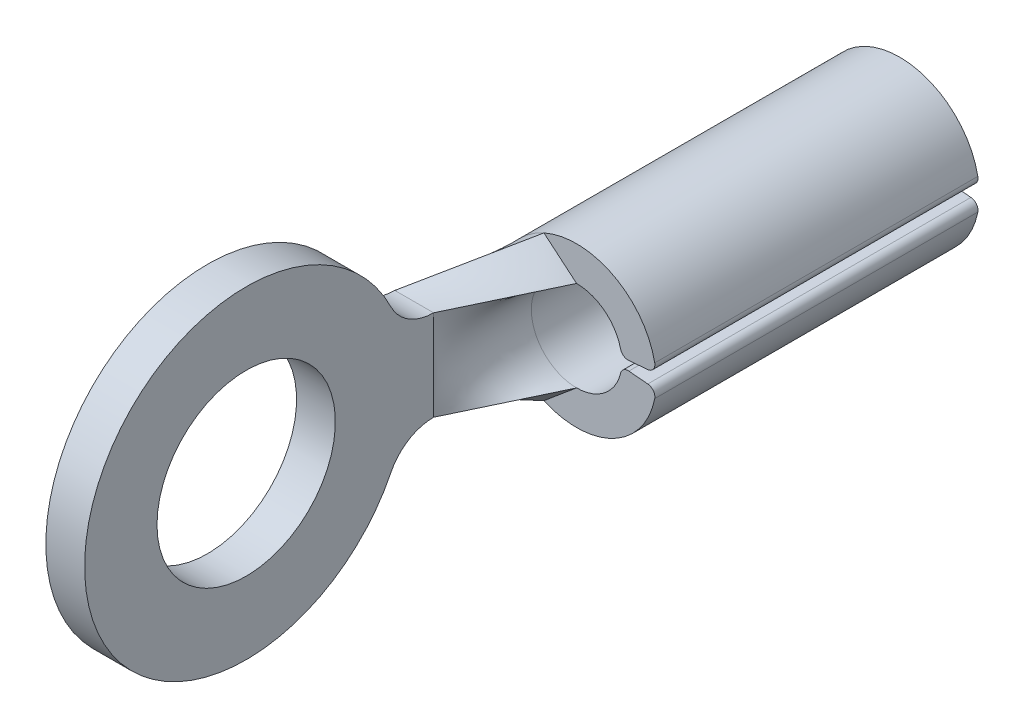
ISO-10303-21;
HEADER;
FILE_DESCRIPTION(('STEP AP214'),'2;1');
FILE_NAME('part.step','',(''),(''),'','','');
FILE_SCHEMA(('AUTOMOTIVE_DESIGN { 1 0 10303 214 1 1 1 1 }'));
ENDSEC;
DATA;
#1=APPLICATION_CONTEXT('core data for automotive mechanical design processes');
#2=APPLICATION_PROTOCOL_DEFINITION('international standard','automotive_design',2000,#1);
#3=PRODUCT_CONTEXT('',#1,'mechanical');
#4=PRODUCT('Part','Part','',(#3));
#5=PRODUCT_RELATED_PRODUCT_CATEGORY('part','',(#4));
#6=PRODUCT_DEFINITION_FORMATION('','',#4);
#7=PRODUCT_DEFINITION_CONTEXT('part definition',#1,'design');
#8=PRODUCT_DEFINITION('design','',#6,#7);
#9=PRODUCT_DEFINITION_SHAPE('','',#8);
#10=(LENGTH_UNIT() NAMED_UNIT(*) SI_UNIT(.MILLI.,.METRE.));
#11=(NAMED_UNIT(*) PLANE_ANGLE_UNIT() SI_UNIT($,.RADIAN.));
#12=(NAMED_UNIT(*) SI_UNIT($,.STERADIAN.) SOLID_ANGLE_UNIT());
#13=UNCERTAINTY_MEASURE_WITH_UNIT(LENGTH_MEASURE(1.E-05),#10,'distance_accuracy_value','');
#14=(GEOMETRIC_REPRESENTATION_CONTEXT(3) GLOBAL_UNCERTAINTY_ASSIGNED_CONTEXT((#13)) GLOBAL_UNIT_ASSIGNED_CONTEXT((#10,
#11,#12)) REPRESENTATION_CONTEXT('',''));
#15=CARTESIAN_POINT('',(0.,0.,0.));
#16=DIRECTION('',(0.,0.,1.));
#17=DIRECTION('',(1.,0.,0.));
#18=AXIS2_PLACEMENT_3D('',#15,#16,#17);
#19=CARTESIAN_POINT('',(0.,1.565275,1.27));
#20=DIRECTION('',(0.,0.,-1.));
#21=DIRECTION('',(0.,1.,0.));
#22=AXIS2_PLACEMENT_3D('',#19,#20,#21);
#23=PLANE('',#22);
#24=DIRECTION('',(0.996194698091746,-0.0871557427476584,0.));
#25=VECTOR('',#24,1.);
#26=CARTESIAN_POINT('',(0.,0.,1.27));
#27=LINE('',#26,#25);
#28=CARTESIAN_POINT('',(1.02626825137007,-0.0897868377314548,1.27));
#29=VERTEX_POINT('',#28);
#30=CARTESIAN_POINT('',(1.39928657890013,-0.122421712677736,1.27));
#31=VERTEX_POINT('',#30);
#32=EDGE_CURVE('E488',#29,#31,#27,.T.);
#33=ORIENTED_EDGE('',*,*,#32,.F.);
#34=CARTESIAN_POINT('',(1.01298571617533,-0.241606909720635,1.27));
#35=DIRECTION('',(0.,0.,-1.));
#36=DIRECTION('',(0.,1.,0.));
#37=AXIS2_PLACEMENT_3D('',#34,#35,#36);
#38=CIRCLE('',#37,0.1524);
#39=CARTESIAN_POINT('',(0.864743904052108,-0.20624980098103,1.27));
#40=VERTEX_POINT('',#39);
#41=EDGE_CURVE('E341',#29,#40,#38,.F.);
#42=ORIENTED_EDGE('',*,*,#41,.T.);
#43=CARTESIAN_POINT('',(0.,0.,1.27));
#44=DIRECTION('',(0.,0.,1.));
#45=DIRECTION('',(0.,-1.,0.));
#46=AXIS2_PLACEMENT_3D('',#43,#44,#45);
#47=CIRCLE('',#46,0.888999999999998);
#48=CARTESIAN_POINT('',(0.,-0.888999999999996,1.27));
#49=VERTEX_POINT('',#48);
#50=EDGE_CURVE('E195',#49,#40,#47,.T.);
#51=ORIENTED_EDGE('',*,*,#50,.F.);
#52=DIRECTION('',(0.766044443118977,0.64278760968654,0.));
#53=VECTOR('',#52,1.);
#54=CARTESIAN_POINT('',(1.20849452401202,0.125047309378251,1.27));
#55=LINE('',#54,#53);
#56=CARTESIAN_POINT('',(-0.641888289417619,-1.42760822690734,1.27));
#57=VERTEX_POINT('',#56);
#58=EDGE_CURVE('E223',#57,#49,#55,.T.);
#59=ORIENTED_EDGE('',*,*,#58,.F.);
#60=CARTESIAN_POINT('',(0.,0.,1.27));
#61=DIRECTION('',(0.,0.,1.));
#62=DIRECTION('',(0.,-1.,0.));
#63=AXIS2_PLACEMENT_3D('',#60,#61,#62);
#64=CIRCLE('',#63,1.565275);
#65=CARTESIAN_POINT('',(1.53550560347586,-0.303822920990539,1.27));
#66=VERTEX_POINT('',#65);
#67=EDGE_CURVE('E320',#57,#66,#64,.T.);
#68=ORIENTED_EDGE('',*,*,#67,.T.);
#69=CARTESIAN_POINT('',(1.38600404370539,-0.274241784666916,1.27));
#70=DIRECTION('',(0.,0.,-1.));
#71=DIRECTION('',(0.,1.,0.));
#72=AXIS2_PLACEMENT_3D('',#69,#70,#71);
#73=CIRCLE('',#72,0.1524);
#74=EDGE_CURVE('E80',#66,#31,#73,.F.);
#75=ORIENTED_EDGE('',*,*,#74,.T.);
#76=EDGE_LOOP('',(#33,#42,#51,#59,#68,#75));
#77=FACE_BOUND('',#76,.T.);
#78=ADVANCED_FACE('F63',(#77),#23,.F.);
#79=CARTESIAN_POINT('',(-0.904875,0.,6.858));
#80=DIRECTION('',(-1.,0.,0.));
#81=DIRECTION('',(0.,0.,1.));
#82=AXIS2_PLACEMENT_3D('',#79,#80,#81);
#83=PLANE('',#82);
#84=CARTESIAN_POINT('',(-0.904875,0.,6.858));
#85=DIRECTION('',(1.,0.,0.));
#86=DIRECTION('',(0.,0.,1.));
#87=AXIS2_PLACEMENT_3D('',#84,#85,#86);
#88=CIRCLE('',#87,3.175);
#89=CARTESIAN_POINT('',(-0.904875,1.40899141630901,4.01276394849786));
#90=VERTEX_POINT('',#89);
#91=CARTESIAN_POINT('',(-0.904875,-1.40899141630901,4.01276394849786));
#92=VERTEX_POINT('',#91);
#93=EDGE_CURVE('E564',#90,#92,#88,.T.);
#94=ORIENTED_EDGE('',*,*,#93,.T.);
#95=CARTESIAN_POINT('',(-0.904875,-1.82386111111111,3.175));
#96=DIRECTION('',(-1.,0.,0.));
#97=DIRECTION('',(0.,0.,1.));
#98=AXIS2_PLACEMENT_3D('',#95,#96,#97);
#99=CIRCLE('',#98,0.934861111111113);
#100=CARTESIAN_POINT('',(-0.904875,-0.889,3.175));
#101=VERTEX_POINT('',#100);
#102=EDGE_CURVE('E557',#92,#101,#99,.T.);
#103=ORIENTED_EDGE('',*,*,#102,.T.);
#104=DIRECTION('',(0.,1.,0.));
#105=VECTOR('',#104,1.);
#106=CARTESIAN_POINT('',(-0.904875,0.,3.175));
#107=LINE('',#106,#105);
#108=CARTESIAN_POINT('',(-0.904875,0.889,3.175));
#109=VERTEX_POINT('',#108);
#110=EDGE_CURVE('E554',#101,#109,#107,.T.);
#111=ORIENTED_EDGE('',*,*,#110,.T.);
#112=CARTESIAN_POINT('',(-0.904875,1.82386111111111,3.175));
#113=DIRECTION('',(-1.,0.,0.));
#114=DIRECTION('',(0.,0.,-1.));
#115=AXIS2_PLACEMENT_3D('',#112,#113,#114);
#116=CIRCLE('',#115,0.934861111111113);
#117=EDGE_CURVE('E556',#109,#90,#116,.T.);
#118=ORIENTED_EDGE('',*,*,#117,.T.);
#119=EDGE_LOOP('',(#94,#103,#111,#118));
#120=FACE_BOUND('',#119,.T.);
#121=CARTESIAN_POINT('',(-0.904875,0.,6.858));
#122=DIRECTION('',(1.,0.,0.));
#123=DIRECTION('',(0.,0.,-1.));
#124=AXIS2_PLACEMENT_3D('',#121,#122,#123);
#125=CIRCLE('',#124,1.7526);
#126=CARTESIAN_POINT('',(-0.904875,0.,8.6106));
#127=VERTEX_POINT('',#126);
#128=EDGE_CURVE('E538',#127,#127,#125,.T.);
#129=ORIENTED_EDGE('',*,*,#128,.F.);
#130=EDGE_LOOP('',(#129));
#131=FACE_BOUND('',#130,.T.);
#132=ADVANCED_FACE('F504',(#120,#131),#83,.F.);
#133=CARTESIAN_POINT('',(-1.666875,0.,6.858));
#134=DIRECTION('',(-1.,0.,0.));
#135=DIRECTION('',(0.,0.,1.));
#136=AXIS2_PLACEMENT_3D('',#133,#134,#135);
#137=PLANE('',#136);
#138=CARTESIAN_POINT('',(-1.666875,0.,6.858));
#139=DIRECTION('',(1.,0.,0.));
#140=DIRECTION('',(0.,0.,-1.));
#141=AXIS2_PLACEMENT_3D('',#138,#139,#140);
#142=CIRCLE('',#141,3.175);
#143=CARTESIAN_POINT('',(-1.666875,1.40899141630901,4.01276394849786));
#144=VERTEX_POINT('',#143);
#145=CARTESIAN_POINT('',(-1.666875,-1.40899141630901,4.01276394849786));
#146=VERTEX_POINT('',#145);
#147=EDGE_CURVE('E568',#144,#146,#142,.T.);
#148=ORIENTED_EDGE('',*,*,#147,.F.);
#149=CARTESIAN_POINT('',(-1.666875,1.82386111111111,3.175));
#150=DIRECTION('',(-1.,0.,0.));
#151=DIRECTION('',(0.,0.,-1.));
#152=AXIS2_PLACEMENT_3D('',#149,#150,#151);
#153=CIRCLE('',#152,0.934861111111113);
#154=CARTESIAN_POINT('',(-1.666875,0.889,3.175));
#155=VERTEX_POINT('',#154);
#156=EDGE_CURVE('E560',#155,#144,#153,.T.);
#157=ORIENTED_EDGE('',*,*,#156,.F.);
#158=DIRECTION('',(0.,1.,0.));
#159=VECTOR('',#158,1.);
#160=CARTESIAN_POINT('',(-1.666875,0.,3.175));
#161=LINE('',#160,#159);
#162=CARTESIAN_POINT('',(-1.666875,-0.889,3.175));
#163=VERTEX_POINT('',#162);
#164=EDGE_CURVE('E372',#163,#155,#161,.T.);
#165=ORIENTED_EDGE('',*,*,#164,.F.);
#166=CARTESIAN_POINT('',(-1.666875,-1.82386111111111,3.175));
#167=DIRECTION('',(-1.,0.,0.));
#168=DIRECTION('',(0.,0.,1.));
#169=AXIS2_PLACEMENT_3D('',#166,#167,#168);
#170=CIRCLE('',#169,0.934861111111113);
#171=EDGE_CURVE('E561',#146,#163,#170,.T.);
#172=ORIENTED_EDGE('',*,*,#171,.F.);
#173=EDGE_LOOP('',(#148,#157,#165,#172));
#174=FACE_BOUND('',#173,.T.);
#175=CARTESIAN_POINT('',(-1.666875,0.,6.858));
#176=DIRECTION('',(1.,0.,0.));
#177=DIRECTION('',(0.,0.,-1.));
#178=AXIS2_PLACEMENT_3D('',#175,#176,#177);
#179=CIRCLE('',#178,1.7526);
#180=CARTESIAN_POINT('',(-1.666875,0.,8.6106));
#181=VERTEX_POINT('',#180);
#182=EDGE_CURVE('E210',#181,#181,#179,.T.);
#183=ORIENTED_EDGE('',*,*,#182,.T.);
#184=EDGE_LOOP('',(#183));
#185=FACE_BOUND('',#184,.T.);
#186=ADVANCED_FACE('F510',(#174,#185),#137,.T.);
#187=CARTESIAN_POINT('',(-0.904875,0.,6.858));
#188=DIRECTION('',(-1.,0.,0.));
#189=DIRECTION('',(0.,0.,1.));
#190=AXIS2_PLACEMENT_3D('',#187,#188,#189);
#191=CYLINDRICAL_SURFACE('',#190,3.175);
#192=ORIENTED_EDGE('',*,*,#147,.T.);
#193=DIRECTION('',(-1.,0.,0.));
#194=VECTOR('',#193,1.);
#195=CARTESIAN_POINT('',(-0.904875,-1.40899141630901,4.01276394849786));
#196=LINE('',#195,#194);
#197=EDGE_CURVE('E445',#92,#146,#196,.T.);
#198=ORIENTED_EDGE('',*,*,#197,.F.);
#199=ORIENTED_EDGE('',*,*,#93,.F.);
#200=DIRECTION('',(-1.,0.,0.));
#201=VECTOR('',#200,1.);
#202=CARTESIAN_POINT('',(-0.904875,1.40899141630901,4.01276394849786));
#203=LINE('',#202,#201);
#204=EDGE_CURVE('E553',#90,#144,#203,.T.);
#205=ORIENTED_EDGE('',*,*,#204,.T.);
#206=EDGE_LOOP('',(#192,#198,#199,#205));
#207=FACE_BOUND('',#206,.T.);
#208=ADVANCED_FACE('F593',(#207),#191,.T.);
#209=CARTESIAN_POINT('',(-0.904875,-1.82386111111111,3.175));
#210=DIRECTION('',(-1.,0.,0.));
#211=DIRECTION('',(0.,0.,1.));
#212=AXIS2_PLACEMENT_3D('',#209,#210,#211);
#213=CYLINDRICAL_SURFACE('',#212,0.934861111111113);
#214=ORIENTED_EDGE('',*,*,#171,.T.);
#215=DIRECTION('',(-1.,0.,0.));
#216=VECTOR('',#215,1.);
#217=CARTESIAN_POINT('',(-0.904875,-0.889,3.175));
#218=LINE('',#217,#216);
#219=EDGE_CURVE('E370',#101,#163,#218,.T.);
#220=ORIENTED_EDGE('',*,*,#219,.F.);
#221=ORIENTED_EDGE('',*,*,#102,.F.);
#222=ORIENTED_EDGE('',*,*,#197,.T.);
#223=EDGE_LOOP('',(#214,#220,#221,#222));
#224=FACE_BOUND('',#223,.T.);
#225=ADVANCED_FACE('F587',(#224),#213,.F.);
#226=CARTESIAN_POINT('',(-0.904875,1.82386111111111,3.175));
#227=DIRECTION('',(-1.,0.,0.));
#228=DIRECTION('',(0.,0.,1.));
#229=AXIS2_PLACEMENT_3D('',#226,#227,#228);
#230=CYLINDRICAL_SURFACE('',#229,0.934861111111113);
#231=ORIENTED_EDGE('',*,*,#156,.T.);
#232=ORIENTED_EDGE('',*,*,#204,.F.);
#233=ORIENTED_EDGE('',*,*,#117,.F.);
#234=DIRECTION('',(-1.,0.,0.));
#235=VECTOR('',#234,1.);
#236=CARTESIAN_POINT('',(-0.904875,0.889,3.175));
#237=LINE('',#236,#235);
#238=EDGE_CURVE('E229',#109,#155,#237,.T.);
#239=ORIENTED_EDGE('',*,*,#238,.T.);
#240=EDGE_LOOP('',(#231,#232,#233,#239));
#241=FACE_BOUND('',#240,.T.);
#242=ADVANCED_FACE('F582',(#241),#230,.F.);
#243=CARTESIAN_POINT('',(-0.904875,0.,6.858));
#244=DIRECTION('',(-1.,0.,0.));
#245=DIRECTION('',(0.,0.,1.));
#246=AXIS2_PLACEMENT_3D('',#243,#244,#245);
#247=CYLINDRICAL_SURFACE('',#246,1.7526);
#248=CARTESIAN_POINT('',(-0.904875,0.,8.6106));
#249=CARTESIAN_POINT('',(-0.9128125,0.,8.6106));
#250=CARTESIAN_POINT('',(-0.92075,0.,8.6106));
#251=CARTESIAN_POINT('',(-0.936625,0.,8.6106));
#252=CARTESIAN_POINT('',(-0.9445625,0.,8.6106));
#253=CARTESIAN_POINT('',(-0.9604375,0.,8.6106));
#254=CARTESIAN_POINT('',(-0.968375,0.,8.6106));
#255=CARTESIAN_POINT('',(-0.98425,0.,8.6106));
#256=CARTESIAN_POINT('',(-0.9921875,0.,8.6106));
#257=CARTESIAN_POINT('',(-1.0080625,0.,8.6106));
#258=CARTESIAN_POINT('',(-1.016,0.,8.6106));
#259=CARTESIAN_POINT('',(-1.031875,0.,8.6106));
#260=CARTESIAN_POINT('',(-1.0398125,0.,8.6106));
#261=CARTESIAN_POINT('',(-1.0556875,0.,8.6106));
#262=CARTESIAN_POINT('',(-1.063625,0.,8.6106));
#263=CARTESIAN_POINT('',(-1.0795,0.,8.6106));
#264=CARTESIAN_POINT('',(-1.0874375,0.,8.6106));
#265=CARTESIAN_POINT('',(-1.1033125,0.,8.6106));
#266=CARTESIAN_POINT('',(-1.11125,0.,8.6106));
#267=CARTESIAN_POINT('',(-1.127125,0.,8.6106));
#268=CARTESIAN_POINT('',(-1.1350625,0.,8.6106));
#269=CARTESIAN_POINT('',(-1.1509375,0.,8.6106));
#270=CARTESIAN_POINT('',(-1.158875,0.,8.6106));
#271=CARTESIAN_POINT('',(-1.17475,0.,8.6106));
#272=CARTESIAN_POINT('',(-1.1826875,0.,8.6106));
#273=CARTESIAN_POINT('',(-1.1985625,0.,8.6106));
#274=CARTESIAN_POINT('',(-1.2065,0.,8.6106));
#275=CARTESIAN_POINT('',(-1.222375,0.,8.6106));
#276=CARTESIAN_POINT('',(-1.2303125,0.,8.6106));
#277=CARTESIAN_POINT('',(-1.2461875,0.,8.6106));
#278=CARTESIAN_POINT('',(-1.254125,0.,8.6106));
#279=CARTESIAN_POINT('',(-1.27,0.,8.6106));
#280=CARTESIAN_POINT('',(-1.2779375,0.,8.6106));
#281=CARTESIAN_POINT('',(-1.2938125,0.,8.6106));
#282=CARTESIAN_POINT('',(-1.30175,0.,8.6106));
#283=CARTESIAN_POINT('',(-1.317625,0.,8.6106));
#284=CARTESIAN_POINT('',(-1.3255625,0.,8.6106));
#285=CARTESIAN_POINT('',(-1.3414375,0.,8.6106));
#286=CARTESIAN_POINT('',(-1.349375,0.,8.6106));
#287=CARTESIAN_POINT('',(-1.36525,0.,8.6106));
#288=CARTESIAN_POINT('',(-1.3731875,0.,8.6106));
#289=CARTESIAN_POINT('',(-1.3890625,0.,8.6106));
#290=CARTESIAN_POINT('',(-1.397,0.,8.6106));
#291=CARTESIAN_POINT('',(-1.412875,0.,8.6106));
#292=CARTESIAN_POINT('',(-1.4208125,0.,8.6106));
#293=CARTESIAN_POINT('',(-1.4366875,0.,8.6106));
#294=CARTESIAN_POINT('',(-1.444625,0.,8.6106));
#295=CARTESIAN_POINT('',(-1.4605,0.,8.6106));
#296=CARTESIAN_POINT('',(-1.4684375,0.,8.6106));
#297=CARTESIAN_POINT('',(-1.4843125,0.,8.6106));
#298=CARTESIAN_POINT('',(-1.49225,0.,8.6106));
#299=CARTESIAN_POINT('',(-1.508125,0.,8.6106));
#300=CARTESIAN_POINT('',(-1.5160625,0.,8.6106));
#301=CARTESIAN_POINT('',(-1.5319375,0.,8.6106));
#302=CARTESIAN_POINT('',(-1.539875,0.,8.6106));
#303=CARTESIAN_POINT('',(-1.55575,0.,8.6106));
#304=CARTESIAN_POINT('',(-1.5636875,0.,8.6106));
#305=CARTESIAN_POINT('',(-1.5795625,0.,8.6106));
#306=CARTESIAN_POINT('',(-1.5875,0.,8.6106));
#307=CARTESIAN_POINT('',(-1.603375,0.,8.6106));
#308=CARTESIAN_POINT('',(-1.6113125,0.,8.6106));
#309=CARTESIAN_POINT('',(-1.6271875,0.,8.6106));
#310=CARTESIAN_POINT('',(-1.635125,0.,8.6106));
#311=CARTESIAN_POINT('',(-1.651,0.,8.6106));
#312=CARTESIAN_POINT('',(-1.6589375,0.,8.6106));
#313=CARTESIAN_POINT('',(-1.666875,0.,8.6106));
#314=B_SPLINE_CURVE_WITH_KNOTS('',3,(#248,#249,#250,#251,#252,#253,#254,#255,#256,#257,#258,
#259,#260,#261,#262,#263,#264,#265,#266,#267,#268,#269,#270,#271,#272,#273,#274,#275,#276,#277,
#278,#279,#280,#281,#282,#283,#284,#285,#286,#287,#288,#289,#290,#291,#292,#293,#294,#295,#296,
#297,#298,#299,#300,#301,#302,#303,#304,#305,#306,#307,#308,#309,#310,#311,#312,#313),
.UNSPECIFIED.,.F.,.F.,(4,2,2,2,2,2,2,2,2,2,2,2,2,2,2,2,2,2,2,2,2,2,2,2,2,2,2,2,2,2,2,2,4),(0.,
0.0238125,0.0476249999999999,0.0714375,0.0952500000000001,0.1190625,0.142875,0.1666875,0.1905,
0.2143125,0.238125,0.2619375,0.28575,0.3095625,0.333375,0.3571875,0.381,0.4048125,0.428625,
0.4524375,0.47625,0.5000625,0.523875,0.5476875,0.5715,0.5953125,0.619125,0.6429375,0.66675,
0.6905625,0.714375,0.7381875,0.762),.UNSPECIFIED.);
#315=EDGE_CURVE('BSEAM256',#127,#181,#314,.T.);
#316=ORIENTED_EDGE('',*,*,#128,.T.);
#317=ORIENTED_EDGE('',*,*,#182,.F.);
#318=ORIENTED_EDGE('',*,*,#315,.T.);
#319=ORIENTED_EDGE('',*,*,#315,.F.);
#320=EDGE_LOOP('',(#316,#318,#317,#319));
#321=FACE_BOUND('',#320,.T.);
#322=ADVANCED_FACE('F256',(#321),#247,.F.);
#323=CARTESIAN_POINT('',(-1.666875,0.889,3.175));
#324=CARTESIAN_POINT('',(-0.641888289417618,1.42760822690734,1.27));
#325=CARTESIAN_POINT('',(-1.539875,0.889,3.175));
#326=CARTESIAN_POINT('',(-0.534906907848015,1.33784018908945,1.27));
#327=CARTESIAN_POINT('',(-1.412875,0.889,3.175));
#328=CARTESIAN_POINT('',(-0.427925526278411,1.24807215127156,1.27));
#329=CARTESIAN_POINT('',(-1.158875,0.889,3.175));
#330=CARTESIAN_POINT('',(-0.213962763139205,1.06853607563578,1.27));
#331=CARTESIAN_POINT('',(-1.031875,0.889,3.175));
#332=CARTESIAN_POINT('',(-0.106981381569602,0.97876803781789,1.27));
#333=CARTESIAN_POINT('',(-0.904875,0.889,3.175));
#334=CARTESIAN_POINT('',(0.,0.889,1.27));
#335=B_SPLINE_SURFACE_WITH_KNOTS('',3,1,((#323,#324),(#325,#326),(#327,#328),(#329,#330),(#331,
#332),(#333,#334)),.UNSPECIFIED.,.F.,.F.,.F.,(4,2,4),(2,2),(0.,0.5,1.),(0.,1.),.UNSPECIFIED.);
#336=DIRECTION('',(0.429056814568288,0.,-0.90327750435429));
#337=VECTOR('',#336,1.);
#338=CARTESIAN_POINT('',(-0.4524375,0.889,2.2225));
#339=LINE('',#338,#337);
#340=CARTESIAN_POINT('',(0.,0.889,1.27));
#341=VERTEX_POINT('',#340);
#342=EDGE_CURVE('E219',#109,#341,#339,.T.);
#343=DIRECTION('',(0.766044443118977,-0.642787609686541,0.));
#344=VECTOR('',#343,1.);
#345=CARTESIAN_POINT('',(-0.333000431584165,1.16842053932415,1.27));
#346=LINE('',#345,#344);
#347=CARTESIAN_POINT('',(-0.641888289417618,1.42760822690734,1.27));
#348=VERTEX_POINT('',#347);
#349=EDGE_CURVE('E199',#348,#341,#346,.T.);
#350=DIRECTION('',(-0.459782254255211,-0.241605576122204,0.854533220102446));
#351=VECTOR('',#350,1.);
#352=CARTESIAN_POINT('',(-1.15438164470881,1.15830411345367,2.2225));
#353=LINE('',#352,#351);
#354=EDGE_CURVE('E231',#348,#155,#353,.T.);
#355=ORIENTED_EDGE('',*,*,#238,.F.);
#356=ORIENTED_EDGE('',*,*,#342,.T.);
#357=ORIENTED_EDGE('',*,*,#349,.F.);
#358=ORIENTED_EDGE('',*,*,#354,.T.);
#359=EDGE_LOOP('',(#355,#356,#357,#358));
#360=FACE_BOUND('',#359,.T.);
#361=ADVANCED_FACE('F228',(#360),#335,.T.);
#362=CARTESIAN_POINT('',(-0.904875,0.889,3.175));
#363=CARTESIAN_POINT('',(0.,0.889,1.27));
#364=CARTESIAN_POINT('',(-0.904875,0.814916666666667,3.175));
#365=CARTESIAN_POINT('',(-0.0740833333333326,0.889,1.27));
#366=CARTESIAN_POINT('',(-0.904875,0.740833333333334,3.175));
#367=CARTESIAN_POINT('',(-0.157886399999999,0.879991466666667,1.27));
#368=CARTESIAN_POINT('',(-0.904875,0.592666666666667,3.175));
#369=CARTESIAN_POINT('',(-0.339953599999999,0.826888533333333,1.27));
#370=CARTESIAN_POINT('',(-0.904875,0.518583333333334,3.175));
#371=CARTESIAN_POINT('',(-0.438573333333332,0.782320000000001,1.27));
#372=CARTESIAN_POINT('',(-0.904875,0.370416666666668,3.175));
#373=CARTESIAN_POINT('',(-0.628226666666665,0.64008,1.27));
#374=CARTESIAN_POINT('',(-0.904875,0.296333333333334,3.175));
#375=CARTESIAN_POINT('',(-0.718787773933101,0.541397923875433,1.27));
#376=CARTESIAN_POINT('',(-0.904875,0.148166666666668,3.175));
#377=CARTESIAN_POINT('',(-0.85003575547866,0.29530795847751,1.27));
#378=CARTESIAN_POINT('',(-0.904875,0.0740833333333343,3.175));
#379=CARTESIAN_POINT('',(-0.888999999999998,0.148166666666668,1.27));
#380=CARTESIAN_POINT('',(-0.904875,-0.0740833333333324,3.175));
#381=CARTESIAN_POINT('',(-0.888999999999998,-0.148166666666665,1.27));
#382=CARTESIAN_POINT('',(-0.904875,-0.148166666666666,3.175));
#383=CARTESIAN_POINT('',(-0.85003575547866,-0.295307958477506,1.27));
#384=CARTESIAN_POINT('',(-0.904875,-0.296333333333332,3.175));
#385=CARTESIAN_POINT('',(-0.718787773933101,-0.541397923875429,1.27));
#386=CARTESIAN_POINT('',(-0.904875,-0.370416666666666,3.175));
#387=CARTESIAN_POINT('',(-0.628226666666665,-0.640079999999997,1.27));
#388=CARTESIAN_POINT('',(-0.904875,-0.518583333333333,3.175));
#389=CARTESIAN_POINT('',(-0.438573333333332,-0.782319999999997,1.27));
#390=CARTESIAN_POINT('',(-0.904875,-0.592666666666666,3.175));
#391=CARTESIAN_POINT('',(-0.339953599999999,-0.82688853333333,1.27));
#392=CARTESIAN_POINT('',(-0.904875,-0.740833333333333,3.175));
#393=CARTESIAN_POINT('',(-0.1578864,-0.879991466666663,1.27));
#394=CARTESIAN_POINT('',(-0.904875,-0.814916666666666,3.175));
#395=CARTESIAN_POINT('',(-0.0740833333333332,-0.888999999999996,1.27));
#396=CARTESIAN_POINT('',(-0.904875,-0.889,3.175));
#397=CARTESIAN_POINT('',(0.,-0.888999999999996,1.27));
#398=B_SPLINE_SURFACE_WITH_KNOTS('',3,1,((#362,#363),(#364,#365),(#366,#367),(#368,#369),(#370,
#371),(#372,#373),(#374,#375),(#376,#377),(#378,#379),(#380,#381),(#382,#383),(#384,#385),(#386,
#387),(#388,#389),(#390,#391),(#392,#393),(#394,#395),(#396,#397)),.UNSPECIFIED.,.F.,.F.,.F.,(4,
2,2,2,2,2,2,2,4),(2,2),(0.,0.125,0.25,0.375,0.5,0.625,0.75,0.875,1.),(0.,1.),.UNSPECIFIED.);
#399=DIRECTION('',(0.429056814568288,0.,-0.90327750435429));
#400=VECTOR('',#399,1.);
#401=CARTESIAN_POINT('',(-0.4524375,-0.888999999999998,2.2225));
#402=LINE('',#401,#400);
#403=EDGE_CURVE('E230',#101,#49,#402,.T.);
#404=CARTESIAN_POINT('',(0.,-0.888999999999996,1.27));
#405=CARTESIAN_POINT('',(-0.0740833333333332,-0.888999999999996,1.27));
#406=CARTESIAN_POINT('',(-0.1578864,-0.879991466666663,1.27));
#407=CARTESIAN_POINT('',(-0.339953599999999,-0.82688853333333,1.27));
#408=CARTESIAN_POINT('',(-0.438573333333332,-0.782319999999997,1.27));
#409=CARTESIAN_POINT('',(-0.628226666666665,-0.640079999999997,1.27));
#410=CARTESIAN_POINT('',(-0.718787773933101,-0.541397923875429,1.27));
#411=CARTESIAN_POINT('',(-0.85003575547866,-0.295307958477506,1.27));
#412=CARTESIAN_POINT('',(-0.888999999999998,-0.148166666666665,1.27));
#413=CARTESIAN_POINT('',(-0.888999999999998,0.148166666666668,1.27));
#414=CARTESIAN_POINT('',(-0.85003575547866,0.29530795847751,1.27));
#415=CARTESIAN_POINT('',(-0.718787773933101,0.541397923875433,1.27));
#416=CARTESIAN_POINT('',(-0.628226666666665,0.64008,1.27));
#417=CARTESIAN_POINT('',(-0.438573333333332,0.782320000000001,1.27));
#418=CARTESIAN_POINT('',(-0.339953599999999,0.826888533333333,1.27));
#419=CARTESIAN_POINT('',(-0.157886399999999,0.879991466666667,1.27));
#420=CARTESIAN_POINT('',(-0.0740833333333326,0.889,1.27));
#421=CARTESIAN_POINT('',(0.,0.889,1.27));
#422=B_SPLINE_CURVE_WITH_KNOTS('',3,(#404,#405,#406,#407,#408,#409,#410,#411,#412,#413,#414,
#415,#416,#417,#418,#419,#420,#421),.UNSPECIFIED.,.F.,.F.,(4,2,2,2,2,2,2,2,4),(0.,0.125,0.25,
0.375,0.5,0.625,0.75,0.875,1.),.UNSPECIFIED.);
#423=CARTESIAN_POINT('',(-0.248938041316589,-0.853507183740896,1.27));
#424=VERTEX_POINT('',#423);
#425=EDGE_CURVE('E299',#424,#49,#422,.F.);
#426=CARTESIAN_POINT('',(0.,-0.888999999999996,1.27));
#427=CARTESIAN_POINT('',(-0.0740833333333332,-0.888999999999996,1.27));
#428=CARTESIAN_POINT('',(-0.1578864,-0.879991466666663,1.27));
#429=CARTESIAN_POINT('',(-0.339953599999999,-0.82688853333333,1.27));
#430=CARTESIAN_POINT('',(-0.438573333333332,-0.782319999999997,1.27));
#431=CARTESIAN_POINT('',(-0.628226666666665,-0.640079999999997,1.27));
#432=CARTESIAN_POINT('',(-0.718787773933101,-0.541397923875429,1.27));
#433=CARTESIAN_POINT('',(-0.85003575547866,-0.295307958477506,1.27));
#434=CARTESIAN_POINT('',(-0.888999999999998,-0.148166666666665,1.27));
#435=CARTESIAN_POINT('',(-0.888999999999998,0.148166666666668,1.27));
#436=CARTESIAN_POINT('',(-0.85003575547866,0.29530795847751,1.27));
#437=CARTESIAN_POINT('',(-0.718787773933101,0.541397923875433,1.27));
#438=CARTESIAN_POINT('',(-0.628226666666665,0.64008,1.27));
#439=CARTESIAN_POINT('',(-0.438573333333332,0.782320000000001,1.27));
#440=CARTESIAN_POINT('',(-0.339953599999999,0.826888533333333,1.27));
#441=CARTESIAN_POINT('',(-0.157886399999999,0.879991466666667,1.27));
#442=CARTESIAN_POINT('',(-0.0740833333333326,0.889,1.27));
#443=CARTESIAN_POINT('',(0.,0.889,1.27));
#444=B_SPLINE_CURVE_WITH_KNOTS('',3,(#426,#427,#428,#429,#430,#431,#432,#433,#434,#435,#436,
#437,#438,#439,#440,#441,#442,#443),.UNSPECIFIED.,.F.,.F.,(4,2,2,2,2,2,2,2,4),(0.,0.125,0.25,
0.375,0.5,0.625,0.75,0.875,1.),.UNSPECIFIED.);
#445=CARTESIAN_POINT('',(-0.248930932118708,0.853475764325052,1.27));
#446=VERTEX_POINT('',#445);
#447=EDGE_CURVE('E221',#446,#424,#444,.F.);
#448=CARTESIAN_POINT('',(0.,0.,1.27));
#449=DIRECTION('',(0.,0.,1.));
#450=DIRECTION('',(0.,-1.,0.));
#451=AXIS2_PLACEMENT_3D('',#448,#449,#450);
#452=CIRCLE('',#451,0.888999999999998);
#453=EDGE_CURVE('E189',#341,#446,#452,.T.);
#454=ORIENTED_EDGE('',*,*,#110,.F.);
#455=ORIENTED_EDGE('',*,*,#403,.T.);
#456=ORIENTED_EDGE('',*,*,#425,.F.);
#457=ORIENTED_EDGE('',*,*,#447,.F.);
#458=ORIENTED_EDGE('',*,*,#453,.F.);
#459=ORIENTED_EDGE('',*,*,#342,.F.);
#460=EDGE_LOOP('',(#454,#455,#456,#457,#458,#459));
#461=FACE_BOUND('',#460,.T.);
#462=ADVANCED_FACE('F218',(#461),#398,.T.);
#463=CARTESIAN_POINT('',(-1.666875,-0.889,3.175));
#464=CARTESIAN_POINT('',(-0.64188828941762,-1.42760822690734,1.27));
#465=CARTESIAN_POINT('',(-1.666875,-0.814916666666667,3.175));
#466=CARTESIAN_POINT('',(-0.750392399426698,-1.37882207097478,1.27));
#467=CARTESIAN_POINT('',(-1.666875,-0.740833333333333,3.175));
#468=CARTESIAN_POINT('',(-0.861633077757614,-1.31389962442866,1.27));
#469=CARTESIAN_POINT('',(-1.666875,-0.592666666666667,3.175));
#470=CARTESIAN_POINT('',(-1.07619169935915,-1.14479483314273,1.27));
#471=CARTESIAN_POINT('',(-1.666875,-0.518583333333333,3.175));
#472=CARTESIAN_POINT('',(-1.17940284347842,-1.04039931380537,1.27));
#473=CARTESIAN_POINT('',(-1.666875,-0.370416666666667,3.175));
#474=CARTESIAN_POINT('',(-1.35830539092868,-0.792734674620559,1.27));
#475=CARTESIAN_POINT('',(-1.666875,-0.296333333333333,3.175));
#476=CARTESIAN_POINT('',(-1.43367994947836,-0.649374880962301,1.27));
#477=CARTESIAN_POINT('',(-1.666875,-0.148166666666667,3.175));
#478=CARTESIAN_POINT('',(-1.5373298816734,-0.337257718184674,1.27));
#479=CARTESIAN_POINT('',(-1.666875,-0.0740833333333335,3.175));
#480=CARTESIAN_POINT('',(-1.565275,-0.168738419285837,1.27));
#481=CARTESIAN_POINT('',(-1.666875,0.0740833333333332,3.175));
#482=CARTESIAN_POINT('',(-1.565275,0.168738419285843,1.27));
#483=CARTESIAN_POINT('',(-1.666875,0.148166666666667,3.175));
#484=CARTESIAN_POINT('',(-1.5373298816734,0.337257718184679,1.27));
#485=CARTESIAN_POINT('',(-1.666875,0.296333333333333,3.175));
#486=CARTESIAN_POINT('',(-1.43367994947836,0.649374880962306,1.27));
#487=CARTESIAN_POINT('',(-1.666875,0.370416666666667,3.175));
#488=CARTESIAN_POINT('',(-1.35830539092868,0.792734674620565,1.27));
#489=CARTESIAN_POINT('',(-1.666875,0.518583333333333,3.175));
#490=CARTESIAN_POINT('',(-1.17940284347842,1.04039931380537,1.27));
#491=CARTESIAN_POINT('',(-1.666875,0.592666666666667,3.175));
#492=CARTESIAN_POINT('',(-1.07619169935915,1.14479483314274,1.27));
#493=CARTESIAN_POINT('',(-1.666875,0.740833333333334,3.175));
#494=CARTESIAN_POINT('',(-0.861633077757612,1.31389962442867,1.27));
#495=CARTESIAN_POINT('',(-1.666875,0.814916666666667,3.175));
#496=CARTESIAN_POINT('',(-0.750392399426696,1.37882207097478,1.27));
#497=CARTESIAN_POINT('',(-1.666875,0.889,3.175));
#498=CARTESIAN_POINT('',(-0.641888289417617,1.42760822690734,1.27));
#499=B_SPLINE_SURFACE_WITH_KNOTS('',3,1,((#463,#464),(#465,#466),(#467,#468),(#469,#470),(#471,
#472),(#473,#474),(#475,#476),(#477,#478),(#479,#480),(#481,#482),(#483,#484),(#485,#486),(#487,
#488),(#489,#490),(#491,#492),(#493,#494),(#495,#496),(#497,#498)),.UNSPECIFIED.,.F.,.F.,.F.,(4,
2,2,2,2,2,2,2,4),(2,2),(0.,0.125,0.25,0.375,0.5,0.625,0.75,0.875,1.),(0.,1.),.UNSPECIFIED.);
#500=CARTESIAN_POINT('',(0.,0.,1.27));
#501=DIRECTION('',(0.,0.,1.));
#502=DIRECTION('',(0.,-1.,0.));
#503=AXIS2_PLACEMENT_3D('',#500,#501,#502);
#504=CIRCLE('',#503,1.565275);
#505=CARTESIAN_POINT('',(-1.48551753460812,0.493320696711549,1.27));
#506=VERTEX_POINT('',#505);
#507=EDGE_CURVE('E351',#348,#506,#504,.T.);
#508=CARTESIAN_POINT('',(-0.641888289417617,1.42760822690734,1.27));
#509=CARTESIAN_POINT('',(-0.750392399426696,1.37882207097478,1.27));
#510=CARTESIAN_POINT('',(-0.861633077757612,1.31389962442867,1.27));
#511=CARTESIAN_POINT('',(-1.07619169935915,1.14479483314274,1.27));
#512=CARTESIAN_POINT('',(-1.17940284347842,1.04039931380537,1.27));
#513=CARTESIAN_POINT('',(-1.35830539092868,0.792734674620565,1.27));
#514=CARTESIAN_POINT('',(-1.43367994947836,0.649374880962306,1.27));
#515=CARTESIAN_POINT('',(-1.5373298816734,0.337257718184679,1.27));
#516=CARTESIAN_POINT('',(-1.565275,0.168738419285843,1.27));
#517=CARTESIAN_POINT('',(-1.565275,-0.168738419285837,1.27));
#518=CARTESIAN_POINT('',(-1.5373298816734,-0.337257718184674,1.27));
#519=CARTESIAN_POINT('',(-1.43367994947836,-0.649374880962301,1.27));
#520=CARTESIAN_POINT('',(-1.35830539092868,-0.792734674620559,1.27));
#521=CARTESIAN_POINT('',(-1.17940284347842,-1.04039931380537,1.27));
#522=CARTESIAN_POINT('',(-1.07619169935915,-1.14479483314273,1.27));
#523=CARTESIAN_POINT('',(-0.861633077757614,-1.31389962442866,1.27));
#524=CARTESIAN_POINT('',(-0.750392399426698,-1.37882207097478,1.27));
#525=CARTESIAN_POINT('',(-0.64188828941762,-1.42760822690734,1.27));
#526=B_SPLINE_CURVE_WITH_KNOTS('',3,(#508,#509,#510,#511,#512,#513,#514,#515,#516,#517,#518,
#519,#520,#521,#522,#523,#524,#525),.UNSPECIFIED.,.F.,.F.,(4,2,2,2,2,2,2,2,4),(0.,0.125,0.25,
0.375,0.5,0.625,0.75,0.875,1.),.UNSPECIFIED.);
#527=CARTESIAN_POINT('',(-1.565275,0.,1.27));
#528=VERTEX_POINT('',#527);
#529=EDGE_CURVE('E236',#506,#528,#526,.T.);
#530=CARTESIAN_POINT('',(-0.641888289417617,1.42760822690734,1.27));
#531=CARTESIAN_POINT('',(-0.750392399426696,1.37882207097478,1.27));
#532=CARTESIAN_POINT('',(-0.861633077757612,1.31389962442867,1.27));
#533=CARTESIAN_POINT('',(-1.07619169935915,1.14479483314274,1.27));
#534=CARTESIAN_POINT('',(-1.17940284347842,1.04039931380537,1.27));
#535=CARTESIAN_POINT('',(-1.35830539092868,0.792734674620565,1.27));
#536=CARTESIAN_POINT('',(-1.43367994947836,0.649374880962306,1.27));
#537=CARTESIAN_POINT('',(-1.5373298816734,0.337257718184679,1.27));
#538=CARTESIAN_POINT('',(-1.565275,0.168738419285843,1.27));
#539=CARTESIAN_POINT('',(-1.565275,-0.168738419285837,1.27));
#540=CARTESIAN_POINT('',(-1.5373298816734,-0.337257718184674,1.27));
#541=CARTESIAN_POINT('',(-1.43367994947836,-0.649374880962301,1.27));
#542=CARTESIAN_POINT('',(-1.35830539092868,-0.792734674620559,1.27));
#543=CARTESIAN_POINT('',(-1.17940284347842,-1.04039931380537,1.27));
#544=CARTESIAN_POINT('',(-1.07619169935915,-1.14479483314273,1.27));
#545=CARTESIAN_POINT('',(-0.861633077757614,-1.31389962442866,1.27));
#546=CARTESIAN_POINT('',(-0.750392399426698,-1.37882207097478,1.27));
#547=CARTESIAN_POINT('',(-0.64188828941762,-1.42760822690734,1.27));
#548=B_SPLINE_CURVE_WITH_KNOTS('',3,(#530,#531,#532,#533,#534,#535,#536,#537,#538,#539,#540,
#541,#542,#543,#544,#545,#546,#547),.UNSPECIFIED.,.F.,.F.,(4,2,2,2,2,2,2,2,4),(0.,0.125,0.25,
0.375,0.5,0.625,0.75,0.875,1.),.UNSPECIFIED.);
#549=CARTESIAN_POINT('',(-1.48550489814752,-0.493316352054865,1.27));
#550=VERTEX_POINT('',#549);
#551=EDGE_CURVE('E380',#528,#550,#548,.T.);
#552=CARTESIAN_POINT('',(-0.641888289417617,1.42760822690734,1.27));
#553=CARTESIAN_POINT('',(-0.750392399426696,1.37882207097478,1.27));
#554=CARTESIAN_POINT('',(-0.861633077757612,1.31389962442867,1.27));
#555=CARTESIAN_POINT('',(-1.07619169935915,1.14479483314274,1.27));
#556=CARTESIAN_POINT('',(-1.17940284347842,1.04039931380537,1.27));
#557=CARTESIAN_POINT('',(-1.35830539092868,0.792734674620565,1.27));
#558=CARTESIAN_POINT('',(-1.43367994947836,0.649374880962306,1.27));
#559=CARTESIAN_POINT('',(-1.5373298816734,0.337257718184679,1.27));
#560=CARTESIAN_POINT('',(-1.565275,0.168738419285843,1.27));
#561=CARTESIAN_POINT('',(-1.565275,-0.168738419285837,1.27));
#562=CARTESIAN_POINT('',(-1.5373298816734,-0.337257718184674,1.27));
#563=CARTESIAN_POINT('',(-1.43367994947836,-0.649374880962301,1.27));
#564=CARTESIAN_POINT('',(-1.35830539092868,-0.792734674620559,1.27));
#565=CARTESIAN_POINT('',(-1.17940284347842,-1.04039931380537,1.27));
#566=CARTESIAN_POINT('',(-1.07619169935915,-1.14479483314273,1.27));
#567=CARTESIAN_POINT('',(-0.861633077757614,-1.31389962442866,1.27));
#568=CARTESIAN_POINT('',(-0.750392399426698,-1.37882207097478,1.27));
#569=CARTESIAN_POINT('',(-0.64188828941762,-1.42760822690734,1.27));
#570=B_SPLINE_CURVE_WITH_KNOTS('',3,(#552,#553,#554,#555,#556,#557,#558,#559,#560,#561,#562,
#563,#564,#565,#566,#567,#568,#569),.UNSPECIFIED.,.F.,.F.,(4,2,2,2,2,2,2,2,4),(0.,0.125,0.25,
0.375,0.5,0.625,0.75,0.875,1.),.UNSPECIFIED.);
#571=CARTESIAN_POINT('',(-1.26885420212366,-0.916566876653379,1.27));
#572=VERTEX_POINT('',#571);
#573=EDGE_CURVE('E376',#550,#572,#570,.T.);
#574=CARTESIAN_POINT('',(-0.641888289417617,1.42760822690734,1.27));
#575=CARTESIAN_POINT('',(-0.750392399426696,1.37882207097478,1.27));
#576=CARTESIAN_POINT('',(-0.861633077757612,1.31389962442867,1.27));
#577=CARTESIAN_POINT('',(-1.07619169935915,1.14479483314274,1.27));
#578=CARTESIAN_POINT('',(-1.17940284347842,1.04039931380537,1.27));
#579=CARTESIAN_POINT('',(-1.35830539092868,0.792734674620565,1.27));
#580=CARTESIAN_POINT('',(-1.43367994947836,0.649374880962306,1.27));
#581=CARTESIAN_POINT('',(-1.5373298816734,0.337257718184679,1.27));
#582=CARTESIAN_POINT('',(-1.565275,0.168738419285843,1.27));
#583=CARTESIAN_POINT('',(-1.565275,-0.168738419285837,1.27));
#584=CARTESIAN_POINT('',(-1.5373298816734,-0.337257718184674,1.27));
#585=CARTESIAN_POINT('',(-1.43367994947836,-0.649374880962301,1.27));
#586=CARTESIAN_POINT('',(-1.35830539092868,-0.792734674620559,1.27));
#587=CARTESIAN_POINT('',(-1.17940284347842,-1.04039931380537,1.27));
#588=CARTESIAN_POINT('',(-1.07619169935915,-1.14479483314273,1.27));
#589=CARTESIAN_POINT('',(-0.861633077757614,-1.31389962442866,1.27));
#590=CARTESIAN_POINT('',(-0.750392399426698,-1.37882207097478,1.27));
#591=CARTESIAN_POINT('',(-0.64188828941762,-1.42760822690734,1.27));
#592=B_SPLINE_CURVE_WITH_KNOTS('',3,(#574,#575,#576,#577,#578,#579,#580,#581,#582,#583,#584,
#585,#586,#587,#588,#589,#590,#591),.UNSPECIFIED.,.F.,.F.,(4,2,2,2,2,2,2,2,4),(0.,0.125,0.25,
0.375,0.5,0.625,0.75,0.875,1.),.UNSPECIFIED.);
#593=EDGE_CURVE('E374',#572,#57,#592,.T.);
#594=DIRECTION('',(0.459782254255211,-0.241605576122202,-0.854533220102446));
#595=VECTOR('',#594,1.);
#596=CARTESIAN_POINT('',(-1.15438164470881,-1.15830411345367,2.2225));
#597=LINE('',#596,#595);
#598=EDGE_CURVE('E234',#163,#57,#597,.T.);
#599=ORIENTED_EDGE('',*,*,#164,.T.);
#600=ORIENTED_EDGE('',*,*,#354,.F.);
#601=ORIENTED_EDGE('',*,*,#507,.T.);
#602=ORIENTED_EDGE('',*,*,#529,.T.);
#603=ORIENTED_EDGE('',*,*,#551,.T.);
#604=ORIENTED_EDGE('',*,*,#573,.T.);
#605=ORIENTED_EDGE('',*,*,#593,.T.);
#606=ORIENTED_EDGE('',*,*,#598,.F.);
#607=EDGE_LOOP('',(#599,#600,#601,#602,#603,#604,#605,#606));
#608=FACE_BOUND('',#607,.T.);
#609=ADVANCED_FACE('F270',(#608),#499,.T.);
#610=CARTESIAN_POINT('',(-0.904875,-0.889,3.175));
#611=CARTESIAN_POINT('',(0.,-0.888999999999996,1.27));
#612=CARTESIAN_POINT('',(-1.031875,-0.889,3.175));
#613=CARTESIAN_POINT('',(-0.106981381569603,-0.978768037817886,1.27));
#614=CARTESIAN_POINT('',(-1.158875,-0.889,3.175));
#615=CARTESIAN_POINT('',(-0.213962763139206,-1.06853607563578,1.27));
#616=CARTESIAN_POINT('',(-1.412875,-0.889,3.175));
#617=CARTESIAN_POINT('',(-0.427925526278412,-1.24807215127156,1.27));
#618=CARTESIAN_POINT('',(-1.539875,-0.889,3.175));
#619=CARTESIAN_POINT('',(-0.534906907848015,-1.33784018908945,1.27));
#620=CARTESIAN_POINT('',(-1.666875,-0.889,3.175));
#621=CARTESIAN_POINT('',(-0.641888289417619,-1.42760822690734,1.27));
#622=B_SPLINE_SURFACE_WITH_KNOTS('',3,1,((#610,#611),(#612,#613),(#614,#615),(#616,#617),(#618,
#619),(#620,#621)),.UNSPECIFIED.,.F.,.F.,.F.,(4,2,4),(2,2),(0.,0.5,1.),(0.,1.),.UNSPECIFIED.);
#623=ORIENTED_EDGE('',*,*,#219,.T.);
#624=ORIENTED_EDGE('',*,*,#598,.T.);
#625=ORIENTED_EDGE('',*,*,#58,.T.);
#626=ORIENTED_EDGE('',*,*,#403,.F.);
#627=EDGE_LOOP('',(#623,#624,#625,#626));
#628=FACE_BOUND('',#627,.T.);
#629=ADVANCED_FACE('F367',(#628),#622,.T.);
#630=CARTESIAN_POINT('',(0.864743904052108,0.206249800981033,1.27));
#631=VERTEX_POINT('',#630);
#632=EDGE_CURVE('E184',#631,#341,#47,.T.);
#633=ORIENTED_EDGE('',*,*,#632,.F.);
#634=CARTESIAN_POINT('',(1.01298571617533,0.241606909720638,1.27));
#635=DIRECTION('',(0.,0.,-1.));
#636=DIRECTION('',(0.,1.,0.));
#637=AXIS2_PLACEMENT_3D('',#634,#635,#636);
#638=CIRCLE('',#637,0.1524);
#639=CARTESIAN_POINT('',(1.02626825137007,0.0897868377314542,1.27));
#640=VERTEX_POINT('',#639);
#641=EDGE_CURVE('E322',#631,#640,#638,.F.);
#642=ORIENTED_EDGE('',*,*,#641,.T.);
#643=DIRECTION('',(-0.996194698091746,-0.0871557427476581,0.));
#644=VECTOR('',#643,1.);
#645=CARTESIAN_POINT('',(0.,0.,1.27));
#646=LINE('',#645,#644);
#647=CARTESIAN_POINT('',(1.39928657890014,0.122421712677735,1.27));
#648=VERTEX_POINT('',#647);
#649=EDGE_CURVE('E490',#648,#640,#646,.T.);
#650=ORIENTED_EDGE('',*,*,#649,.F.);
#651=CARTESIAN_POINT('',(1.38600404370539,0.274241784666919,1.27));
#652=DIRECTION('',(0.,0.,-1.));
#653=DIRECTION('',(0.,1.,0.));
#654=AXIS2_PLACEMENT_3D('',#651,#652,#653);
#655=CIRCLE('',#654,0.1524);
#656=CARTESIAN_POINT('',(1.53550560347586,0.303822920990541,1.27));
#657=VERTEX_POINT('',#656);
#658=EDGE_CURVE('E318',#648,#657,#655,.F.);
#659=ORIENTED_EDGE('',*,*,#658,.T.);
#660=EDGE_CURVE('E203',#657,#348,#64,.T.);
#661=ORIENTED_EDGE('',*,*,#660,.T.);
#662=ORIENTED_EDGE('',*,*,#349,.T.);
#663=EDGE_LOOP('',(#633,#642,#650,#659,#661,#662));
#664=FACE_BOUND('',#663,.T.);
#665=ADVANCED_FACE('F201',(#664),#23,.F.);
#666=CARTESIAN_POINT('',(0.,0.,10.033));
#667=DIRECTION('',(0.,0.,1.));
#668=DIRECTION('',(0.,-1.,0.));
#669=AXIS2_PLACEMENT_3D('',#666,#667,#668);
#670=CYLINDRICAL_SURFACE('',#669,1.565275);
#671=CARTESIAN_POINT('',(0.,0.,-5.08));
#672=DIRECTION('',(0.,0.,1.));
#673=DIRECTION('',(0.,-1.,0.));
#674=AXIS2_PLACEMENT_3D('',#671,#672,#673);
#675=CIRCLE('',#674,1.565275);
#676=CARTESIAN_POINT('',(1.53550560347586,0.303822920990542,-5.08));
#677=VERTEX_POINT('',#676);
#678=CARTESIAN_POINT('',(1.53550560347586,-0.303822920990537,-5.08));
#679=VERTEX_POINT('',#678);
#680=EDGE_CURVE('E439',#677,#679,#675,.T.);
#681=ORIENTED_EDGE('',*,*,#680,.T.);
#682=DIRECTION('',(0.,0.,1.));
#683=VECTOR('',#682,1.);
#684=CARTESIAN_POINT('',(1.53550560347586,-0.30382292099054,10.033));
#685=LINE('',#684,#683);
#686=EDGE_CURVE('E12',#679,#66,#685,.T.);
#687=ORIENTED_EDGE('',*,*,#686,.T.);
#688=ORIENTED_EDGE('',*,*,#67,.F.);
#689=ORIENTED_EDGE('',*,*,#593,.F.);
#690=ORIENTED_EDGE('',*,*,#573,.F.);
#691=ORIENTED_EDGE('',*,*,#551,.F.);
#692=ORIENTED_EDGE('',*,*,#529,.F.);
#693=ORIENTED_EDGE('',*,*,#507,.F.);
#694=ORIENTED_EDGE('',*,*,#660,.F.);
#695=DIRECTION('',(0.,0.,1.));
#696=VECTOR('',#695,1.);
#697=CARTESIAN_POINT('',(1.53550560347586,0.30382292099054,10.033));
#698=LINE('',#697,#696);
#699=EDGE_CURVE('E72',#657,#677,#698,.F.);
#700=ORIENTED_EDGE('',*,*,#699,.T.);
#701=EDGE_LOOP('',(#681,#687,#688,#689,#690,#691,#692,#693,#694,#700));
#702=FACE_BOUND('',#701,.T.);
#703=ADVANCED_FACE('F257',(#702),#670,.T.);
#704=CARTESIAN_POINT('',(0.,0.,10.033));
#705=DIRECTION('',(0.,0.,1.));
#706=DIRECTION('',(0.,-1.,0.));
#707=AXIS2_PLACEMENT_3D('',#704,#705,#706);
#708=CYLINDRICAL_SURFACE('',#707,0.888999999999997);
#709=CARTESIAN_POINT('',(0.,0.,-5.08));
#710=DIRECTION('',(0.,0.,1.));
#711=DIRECTION('',(0.,-1.,0.));
#712=AXIS2_PLACEMENT_3D('',#709,#710,#711);
#713=CIRCLE('',#712,0.888999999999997);
#714=CARTESIAN_POINT('',(0.864743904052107,0.206249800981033,-5.08));
#715=VERTEX_POINT('',#714);
#716=CARTESIAN_POINT('',(0.864743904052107,-0.206249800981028,-5.08));
#717=VERTEX_POINT('',#716);
#718=EDGE_CURVE('E196',#715,#717,#713,.T.);
#719=ORIENTED_EDGE('',*,*,#718,.F.);
#720=DIRECTION('',(0.,0.,1.));
#721=VECTOR('',#720,1.);
#722=CARTESIAN_POINT('',(0.864743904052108,0.206249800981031,10.033));
#723=LINE('',#722,#721);
#724=EDGE_CURVE('E193',#715,#631,#723,.T.);
#725=ORIENTED_EDGE('',*,*,#724,.T.);
#726=ORIENTED_EDGE('',*,*,#632,.T.);
#727=ORIENTED_EDGE('',*,*,#453,.T.);
#728=ORIENTED_EDGE('',*,*,#447,.T.);
#729=ORIENTED_EDGE('',*,*,#425,.T.);
#730=ORIENTED_EDGE('',*,*,#50,.T.);
#731=DIRECTION('',(0.,0.,1.));
#732=VECTOR('',#731,1.);
#733=CARTESIAN_POINT('',(0.864743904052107,-0.206249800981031,10.033));
#734=LINE('',#733,#732);
#735=EDGE_CURVE('E314',#40,#717,#734,.F.);
#736=ORIENTED_EDGE('',*,*,#735,.T.);
#737=EDGE_LOOP('',(#719,#725,#726,#727,#728,#729,#730,#736));
#738=FACE_BOUND('',#737,.T.);
#739=ADVANCED_FACE('F187',(#738),#708,.F.);
#740=CARTESIAN_POINT('',(0.,0.889,-5.08));
#741=DIRECTION('',(0.,0.,1.));
#742=DIRECTION('',(0.,-1.,0.));
#743=AXIS2_PLACEMENT_3D('',#740,#741,#742);
#744=PLANE('',#743);
#745=DIRECTION('',(-0.996194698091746,-0.0871557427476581,0.));
#746=VECTOR('',#745,1.);
#747=CARTESIAN_POINT('',(0.0771866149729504,0.0067529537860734,-5.08));
#748=LINE('',#747,#746);
#749=CARTESIAN_POINT('',(1.39928657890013,0.122421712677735,-5.08));
#750=VERTEX_POINT('',#749);
#751=CARTESIAN_POINT('',(1.02626825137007,0.0897868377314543,-5.08));
#752=VERTEX_POINT('',#751);
#753=EDGE_CURVE('E437',#750,#752,#748,.T.);
#754=ORIENTED_EDGE('',*,*,#753,.T.);
#755=CARTESIAN_POINT('',(1.01298571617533,0.241606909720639,-5.08));
#756=DIRECTION('',(0.,0.,1.));
#757=DIRECTION('',(0.,-1.,0.));
#758=AXIS2_PLACEMENT_3D('',#755,#756,#757);
#759=CIRCLE('',#758,0.1524);
#760=EDGE_CURVE('E334',#752,#715,#759,.F.);
#761=ORIENTED_EDGE('',*,*,#760,.T.);
#762=ORIENTED_EDGE('',*,*,#718,.T.);
#763=CARTESIAN_POINT('',(1.01298571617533,-0.241606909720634,-5.08));
#764=DIRECTION('',(0.,0.,1.));
#765=DIRECTION('',(0.,-1.,0.));
#766=AXIS2_PLACEMENT_3D('',#763,#764,#765);
#767=CIRCLE('',#766,0.1524);
#768=CARTESIAN_POINT('',(1.02626825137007,-0.0897868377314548,-5.08));
#769=VERTEX_POINT('',#768);
#770=EDGE_CURVE('E332',#717,#769,#767,.F.);
#771=ORIENTED_EDGE('',*,*,#770,.T.);
#772=DIRECTION('',(0.996194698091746,-0.0871557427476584,0.));
#773=VECTOR('',#772,1.);
#774=CARTESIAN_POINT('',(-0.0771866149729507,0.0067529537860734,-5.08));
#775=LINE('',#774,#773);
#776=CARTESIAN_POINT('',(1.39928657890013,-0.122421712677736,-5.08));
#777=VERTEX_POINT('',#776);
#778=EDGE_CURVE('E312',#769,#777,#775,.T.);
#779=ORIENTED_EDGE('',*,*,#778,.T.);
#780=CARTESIAN_POINT('',(1.38600404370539,-0.274241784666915,-5.08));
#781=DIRECTION('',(0.,0.,1.));
#782=DIRECTION('',(0.,-1.,0.));
#783=AXIS2_PLACEMENT_3D('',#780,#781,#782);
#784=CIRCLE('',#783,0.1524);
#785=EDGE_CURVE('E330',#777,#679,#784,.F.);
#786=ORIENTED_EDGE('',*,*,#785,.T.);
#787=ORIENTED_EDGE('',*,*,#680,.F.);
#788=CARTESIAN_POINT('',(1.38600404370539,0.27424178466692,-5.08));
#789=DIRECTION('',(0.,0.,1.));
#790=DIRECTION('',(0.,-1.,0.));
#791=AXIS2_PLACEMENT_3D('',#788,#789,#790);
#792=CIRCLE('',#791,0.1524);
#793=EDGE_CURVE('E328',#677,#750,#792,.F.);
#794=ORIENTED_EDGE('',*,*,#793,.T.);
#795=EDGE_LOOP('',(#754,#761,#762,#771,#779,#786,#787,#794));
#796=FACE_BOUND('',#795,.T.);
#797=ADVANCED_FACE('F436',(#796),#744,.F.);
#798=CARTESIAN_POINT('',(0.,0.,-5.08));
#799=DIRECTION('',(-0.0871557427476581,0.996194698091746,0.));
#800=DIRECTION('',(-0.996194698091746,-0.0871557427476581,0.));
#801=AXIS2_PLACEMENT_3D('',#798,#799,#800);
#802=PLANE('',#801);
#803=ORIENTED_EDGE('',*,*,#649,.T.);
#804=DIRECTION('',(0.,0.,1.));
#805=VECTOR('',#804,1.);
#806=CARTESIAN_POINT('',(1.02626825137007,0.0897868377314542,-5.08));
#807=LINE('',#806,#805);
#808=EDGE_CURVE('E326',#640,#752,#807,.F.);
#809=ORIENTED_EDGE('',*,*,#808,.T.);
#810=ORIENTED_EDGE('',*,*,#753,.F.);
#811=DIRECTION('',(0.,0.,1.));
#812=VECTOR('',#811,1.);
#813=CARTESIAN_POINT('',(1.39928657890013,0.122421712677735,-5.08));
#814=LINE('',#813,#812);
#815=EDGE_CURVE('E324',#750,#648,#814,.T.);
#816=ORIENTED_EDGE('',*,*,#815,.T.);
#817=EDGE_LOOP('',(#803,#809,#810,#816));
#818=FACE_BOUND('',#817,.T.);
#819=ADVANCED_FACE('F442',(#818),#802,.F.);
#820=CARTESIAN_POINT('',(0.,0.,-5.08));
#821=DIRECTION('',(-0.0871557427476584,-0.996194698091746,0.));
#822=DIRECTION('',(0.996194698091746,-0.0871557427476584,0.));
#823=AXIS2_PLACEMENT_3D('',#820,#821,#822);
#824=PLANE('',#823);
#825=ORIENTED_EDGE('',*,*,#778,.F.);
#826=DIRECTION('',(0.,0.,1.));
#827=VECTOR('',#826,1.);
#828=CARTESIAN_POINT('',(1.02626825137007,-0.0897868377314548,-5.08));
#829=LINE('',#828,#827);
#830=EDGE_CURVE('E338',#769,#29,#829,.T.);
#831=ORIENTED_EDGE('',*,*,#830,.T.);
#832=ORIENTED_EDGE('',*,*,#32,.T.);
#833=DIRECTION('',(0.,0.,1.));
#834=VECTOR('',#833,1.);
#835=CARTESIAN_POINT('',(1.39928657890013,-0.122421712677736,-5.08));
#836=LINE('',#835,#834);
#837=EDGE_CURVE('E336',#31,#777,#836,.F.);
#838=ORIENTED_EDGE('',*,*,#837,.T.);
#839=EDGE_LOOP('',(#825,#831,#832,#838));
#840=FACE_BOUND('',#839,.T.);
#841=ADVANCED_FACE('F487',(#840),#824,.F.);
#842=CARTESIAN_POINT('',(1.01298571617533,0.241606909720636,10.033));
#843=DIRECTION('',(0.,0.,1.));
#844=DIRECTION('',(0.,-1.,0.));
#845=AXIS2_PLACEMENT_3D('',#842,#843,#844);
#846=CYLINDRICAL_SURFACE('',#845,0.1524);
#847=ORIENTED_EDGE('',*,*,#760,.F.);
#848=ORIENTED_EDGE('',*,*,#808,.F.);
#849=ORIENTED_EDGE('',*,*,#641,.F.);
#850=ORIENTED_EDGE('',*,*,#724,.F.);
#851=EDGE_LOOP('',(#847,#848,#849,#850));
#852=FACE_BOUND('',#851,.T.);
#853=ADVANCED_FACE('F494',(#852),#846,.T.);
#854=CARTESIAN_POINT('',(1.01298571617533,-0.241606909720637,10.033));
#855=DIRECTION('',(0.,0.,1.));
#856=DIRECTION('',(0.,-1.,0.));
#857=AXIS2_PLACEMENT_3D('',#854,#855,#856);
#858=CYLINDRICAL_SURFACE('',#857,0.1524);
#859=ORIENTED_EDGE('',*,*,#41,.F.);
#860=ORIENTED_EDGE('',*,*,#830,.F.);
#861=ORIENTED_EDGE('',*,*,#770,.F.);
#862=ORIENTED_EDGE('',*,*,#735,.F.);
#863=EDGE_LOOP('',(#859,#860,#861,#862));
#864=FACE_BOUND('',#863,.T.);
#865=ADVANCED_FACE('F482',(#864),#858,.T.);
#866=CARTESIAN_POINT('',(1.38600404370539,-0.274241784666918,10.033));
#867=DIRECTION('',(0.,0.,1.));
#868=DIRECTION('',(0.,-1.,0.));
#869=AXIS2_PLACEMENT_3D('',#866,#867,#868);
#870=CYLINDRICAL_SURFACE('',#869,0.1524);
#871=ORIENTED_EDGE('',*,*,#785,.F.);
#872=ORIENTED_EDGE('',*,*,#837,.F.);
#873=ORIENTED_EDGE('',*,*,#74,.F.);
#874=ORIENTED_EDGE('',*,*,#686,.F.);
#875=EDGE_LOOP('',(#871,#872,#873,#874));
#876=FACE_BOUND('',#875,.T.);
#877=ADVANCED_FACE('F489',(#876),#870,.T.);
#878=CARTESIAN_POINT('',(1.38600404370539,0.274241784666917,10.033));
#879=DIRECTION('',(0.,0.,1.));
#880=DIRECTION('',(0.,-1.,0.));
#881=AXIS2_PLACEMENT_3D('',#878,#879,#880);
#882=CYLINDRICAL_SURFACE('',#881,0.1524);
#883=ORIENTED_EDGE('',*,*,#658,.F.);
#884=ORIENTED_EDGE('',*,*,#815,.F.);
#885=ORIENTED_EDGE('',*,*,#793,.F.);
#886=ORIENTED_EDGE('',*,*,#699,.F.);
#887=EDGE_LOOP('',(#883,#884,#885,#886));
#888=FACE_BOUND('',#887,.T.);
#889=ADVANCED_FACE('F65',(#888),#882,.T.);
#890=CLOSED_SHELL('',(#78,#132,#186,#208,#225,#242,#322,#361,#462,#609,#629,#665,#703,#739,#797,
#819,#841,#853,#865,#877,#889));
#891=MANIFOLD_SOLID_BREP('B2',#890);
#892=ADVANCED_BREP_SHAPE_REPRESENTATION('',(#18,#891),#14);
#893=SHAPE_DEFINITION_REPRESENTATION(#9,#892);
ENDSEC;
END-ISO-10303-21;
